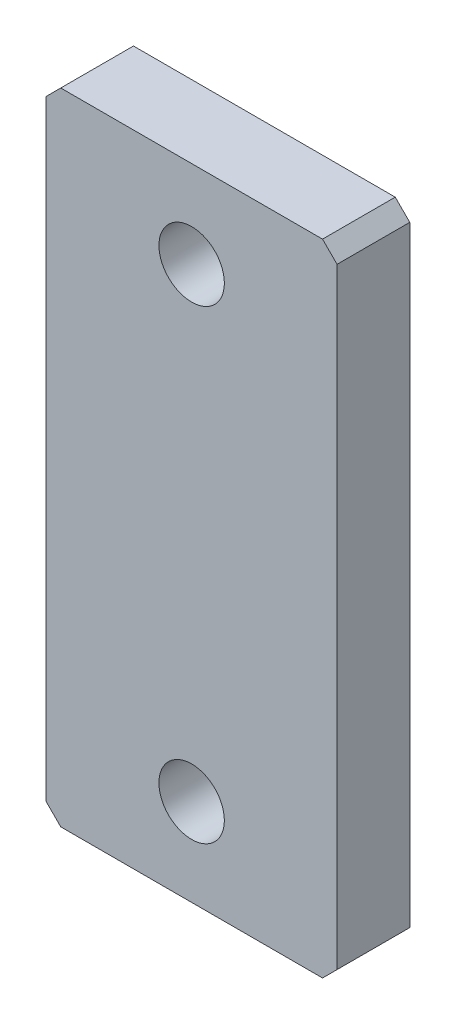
from build123d import *

# Parameters (mm, degrees)
SKETCH_1_R                          = 2.25
BRIDGE_OVER_EXISTING_8MM_RAIL_DEPTH = 5


with BuildPart() as part:
    # Sketch 1 → Bridge_over_existing_8mm_rail (new body)
    with BuildSketch(Plane.XY):
        Polygon((-9, -22), (9, -22), (10, -21), (10, 21), (9, 22), (-9, 22), (-10, 21), (-10, -21), align=None)
        with Locations((0, -16)):
            Circle(SKETCH_1_R, mode=Mode.SUBTRACT)
        with Locations((0, 16)):
            Circle(SKETCH_1_R, mode=Mode.SUBTRACT)
    extrude(amount=BRIDGE_OVER_EXISTING_8MM_RAIL_DEPTH)


solid = part.part
